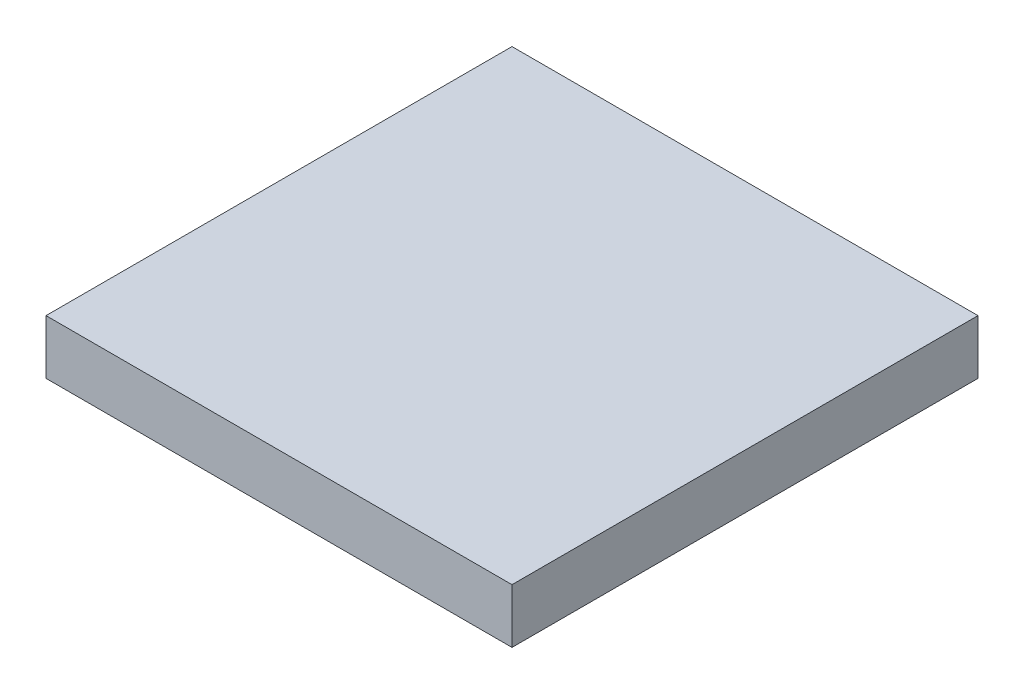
ISO-10303-21;
HEADER;
FILE_DESCRIPTION(('STEP AP214'),'2;1');
FILE_NAME('part.step','',(''),(''),'','','');
FILE_SCHEMA(('AUTOMOTIVE_DESIGN { 1 0 10303 214 1 1 1 1 }'));
ENDSEC;
DATA;
#1=APPLICATION_CONTEXT('core data for automotive mechanical design processes');
#2=APPLICATION_PROTOCOL_DEFINITION('international standard','automotive_design',2000,#1);
#3=PRODUCT_CONTEXT('',#1,'mechanical');
#4=PRODUCT('Part','Part','',(#3));
#5=PRODUCT_RELATED_PRODUCT_CATEGORY('part','',(#4));
#6=PRODUCT_DEFINITION_FORMATION('','',#4);
#7=PRODUCT_DEFINITION_CONTEXT('part definition',#1,'design');
#8=PRODUCT_DEFINITION('design','',#6,#7);
#9=PRODUCT_DEFINITION_SHAPE('','',#8);
#10=(LENGTH_UNIT() NAMED_UNIT(*) SI_UNIT(.MILLI.,.METRE.));
#11=(NAMED_UNIT(*) PLANE_ANGLE_UNIT() SI_UNIT($,.RADIAN.));
#12=(NAMED_UNIT(*) SI_UNIT($,.STERADIAN.) SOLID_ANGLE_UNIT());
#13=UNCERTAINTY_MEASURE_WITH_UNIT(LENGTH_MEASURE(1.E-05),#10,'distance_accuracy_value','');
#14=(GEOMETRIC_REPRESENTATION_CONTEXT(3) GLOBAL_UNCERTAINTY_ASSIGNED_CONTEXT((#13)) GLOBAL_UNIT_ASSIGNED_CONTEXT((#10,
#11,#12)) REPRESENTATION_CONTEXT('',''));
#15=CARTESIAN_POINT('',(0.,0.,0.));
#16=DIRECTION('',(0.,0.,1.));
#17=DIRECTION('',(1.,0.,0.));
#18=AXIS2_PLACEMENT_3D('',#15,#16,#17);
#19=CARTESIAN_POINT('',(0.,7.,0.));
#20=DIRECTION('',(1.,0.,0.));
#21=DIRECTION('',(0.,0.,-1.));
#22=AXIS2_PLACEMENT_3D('',#19,#20,#21);
#23=PLANE('',#22);
#24=DIRECTION('',(0.,0.,1.));
#25=VECTOR('',#24,1.);
#26=CARTESIAN_POINT('',(0.,0.,0.));
#27=LINE('',#26,#25);
#28=CARTESIAN_POINT('',(0.,0.,-60.));
#29=VERTEX_POINT('',#28);
#30=CARTESIAN_POINT('',(0.,0.,0.));
#31=VERTEX_POINT('',#30);
#32=EDGE_CURVE('E75',#29,#31,#27,.T.);
#33=ORIENTED_EDGE('',*,*,#32,.T.);
#34=DIRECTION('',(0.,-1.,0.));
#35=VECTOR('',#34,1.);
#36=CARTESIAN_POINT('',(0.,7.,0.));
#37=LINE('',#36,#35);
#38=CARTESIAN_POINT('',(0.,7.,0.));
#39=VERTEX_POINT('',#38);
#40=EDGE_CURVE('E11',#39,#31,#37,.T.);
#41=ORIENTED_EDGE('',*,*,#40,.F.);
#42=DIRECTION('',(0.,0.,1.));
#43=VECTOR('',#42,1.);
#44=CARTESIAN_POINT('',(0.,7.,0.));
#45=LINE('',#44,#43);
#46=CARTESIAN_POINT('',(0.,7.,-60.));
#47=VERTEX_POINT('',#46);
#48=EDGE_CURVE('E93',#47,#39,#45,.T.);
#49=ORIENTED_EDGE('',*,*,#48,.F.);
#50=DIRECTION('',(0.,-1.,0.));
#51=VECTOR('',#50,1.);
#52=CARTESIAN_POINT('',(0.,7.,-60.));
#53=LINE('',#52,#51);
#54=EDGE_CURVE('E87',#47,#29,#53,.T.);
#55=ORIENTED_EDGE('',*,*,#54,.T.);
#56=EDGE_LOOP('',(#33,#41,#49,#55));
#57=FACE_BOUND('',#56,.T.);
#58=ADVANCED_FACE('F31',(#57),#23,.F.);
#59=CARTESIAN_POINT('',(0.,7.,0.));
#60=DIRECTION('',(0.,0.,-1.));
#61=DIRECTION('',(-1.,0.,0.));
#62=AXIS2_PLACEMENT_3D('',#59,#60,#61);
#63=PLANE('',#62);
#64=DIRECTION('',(1.,0.,0.));
#65=VECTOR('',#64,1.);
#66=CARTESIAN_POINT('',(0.,0.,0.));
#67=LINE('',#66,#65);
#68=CARTESIAN_POINT('',(60.,0.,0.));
#69=VERTEX_POINT('',#68);
#70=EDGE_CURVE('E71',#31,#69,#67,.T.);
#71=ORIENTED_EDGE('',*,*,#70,.T.);
#72=DIRECTION('',(0.,-1.,0.));
#73=VECTOR('',#72,1.);
#74=CARTESIAN_POINT('',(60.,7.,0.));
#75=LINE('',#74,#73);
#76=CARTESIAN_POINT('',(60.,7.,0.));
#77=VERTEX_POINT('',#76);
#78=EDGE_CURVE('E38',#77,#69,#75,.T.);
#79=ORIENTED_EDGE('',*,*,#78,.F.);
#80=DIRECTION('',(1.,0.,0.));
#81=VECTOR('',#80,1.);
#82=CARTESIAN_POINT('',(0.,7.,0.));
#83=LINE('',#82,#81);
#84=EDGE_CURVE('E83',#39,#77,#83,.T.);
#85=ORIENTED_EDGE('',*,*,#84,.F.);
#86=ORIENTED_EDGE('',*,*,#40,.T.);
#87=EDGE_LOOP('',(#71,#79,#85,#86));
#88=FACE_BOUND('',#87,.T.);
#89=ADVANCED_FACE('F82',(#88),#63,.F.);
#90=CARTESIAN_POINT('',(60.,7.,0.));
#91=DIRECTION('',(-1.,0.,0.));
#92=DIRECTION('',(0.,0.,1.));
#93=AXIS2_PLACEMENT_3D('',#90,#91,#92);
#94=PLANE('',#93);
#95=DIRECTION('',(0.,0.,-1.));
#96=VECTOR('',#95,1.);
#97=CARTESIAN_POINT('',(60.,0.,0.));
#98=LINE('',#97,#96);
#99=CARTESIAN_POINT('',(60.,0.,-60.));
#100=VERTEX_POINT('',#99);
#101=EDGE_CURVE('E76',#69,#100,#98,.T.);
#102=ORIENTED_EDGE('',*,*,#101,.T.);
#103=DIRECTION('',(0.,-1.,0.));
#104=VECTOR('',#103,1.);
#105=CARTESIAN_POINT('',(60.,7.,-60.));
#106=LINE('',#105,#104);
#107=CARTESIAN_POINT('',(60.,7.,-60.));
#108=VERTEX_POINT('',#107);
#109=EDGE_CURVE('E99',#108,#100,#106,.T.);
#110=ORIENTED_EDGE('',*,*,#109,.F.);
#111=DIRECTION('',(0.,0.,-1.));
#112=VECTOR('',#111,1.);
#113=CARTESIAN_POINT('',(60.,7.,0.));
#114=LINE('',#113,#112);
#115=EDGE_CURVE('E50',#77,#108,#114,.T.);
#116=ORIENTED_EDGE('',*,*,#115,.F.);
#117=ORIENTED_EDGE('',*,*,#78,.T.);
#118=EDGE_LOOP('',(#102,#110,#116,#117));
#119=FACE_BOUND('',#118,.T.);
#120=ADVANCED_FACE('F102',(#119),#94,.F.);
#121=CARTESIAN_POINT('',(0.,7.,-60.));
#122=DIRECTION('',(0.,0.,1.));
#123=DIRECTION('',(1.,0.,0.));
#124=AXIS2_PLACEMENT_3D('',#121,#122,#123);
#125=PLANE('',#124);
#126=DIRECTION('',(-1.,0.,0.));
#127=VECTOR('',#126,1.);
#128=CARTESIAN_POINT('',(0.,0.,-60.));
#129=LINE('',#128,#127);
#130=EDGE_CURVE('E91',#100,#29,#129,.T.);
#131=ORIENTED_EDGE('',*,*,#130,.T.);
#132=ORIENTED_EDGE('',*,*,#54,.F.);
#133=DIRECTION('',(-1.,0.,0.));
#134=VECTOR('',#133,1.);
#135=CARTESIAN_POINT('',(0.,7.,-60.));
#136=LINE('',#135,#134);
#137=EDGE_CURVE('E45',#108,#47,#136,.T.);
#138=ORIENTED_EDGE('',*,*,#137,.F.);
#139=ORIENTED_EDGE('',*,*,#109,.T.);
#140=EDGE_LOOP('',(#131,#132,#138,#139));
#141=FACE_BOUND('',#140,.T.);
#142=ADVANCED_FACE('F104',(#141),#125,.F.);
#143=CARTESIAN_POINT('',(0.,7.,-60.));
#144=DIRECTION('',(0.,-1.,0.));
#145=DIRECTION('',(0.,0.,-1.));
#146=AXIS2_PLACEMENT_3D('',#143,#144,#145);
#147=PLANE('',#146);
#148=ORIENTED_EDGE('',*,*,#48,.T.);
#149=ORIENTED_EDGE('',*,*,#84,.T.);
#150=ORIENTED_EDGE('',*,*,#115,.T.);
#151=ORIENTED_EDGE('',*,*,#137,.T.);
#152=EDGE_LOOP('',(#148,#149,#150,#151));
#153=FACE_BOUND('',#152,.T.);
#154=ADVANCED_FACE('F105',(#153),#147,.F.);
#155=CARTESIAN_POINT('',(0.,0.,-60.));
#156=DIRECTION('',(0.,-1.,0.));
#157=DIRECTION('',(0.,0.,-1.));
#158=AXIS2_PLACEMENT_3D('',#155,#156,#157);
#159=PLANE('',#158);
#160=ORIENTED_EDGE('',*,*,#32,.F.);
#161=ORIENTED_EDGE('',*,*,#130,.F.);
#162=ORIENTED_EDGE('',*,*,#101,.F.);
#163=ORIENTED_EDGE('',*,*,#70,.F.);
#164=EDGE_LOOP('',(#160,#161,#162,#163));
#165=FACE_BOUND('',#164,.T.);
#166=ADVANCED_FACE('F72',(#165),#159,.T.);
#167=CLOSED_SHELL('',(#58,#89,#120,#142,#154,#166));
#168=MANIFOLD_SOLID_BREP('B2',#167);
#169=ADVANCED_BREP_SHAPE_REPRESENTATION('',(#18,#168),#14);
#170=SHAPE_DEFINITION_REPRESENTATION(#9,#169);
ENDSEC;
END-ISO-10303-21;
